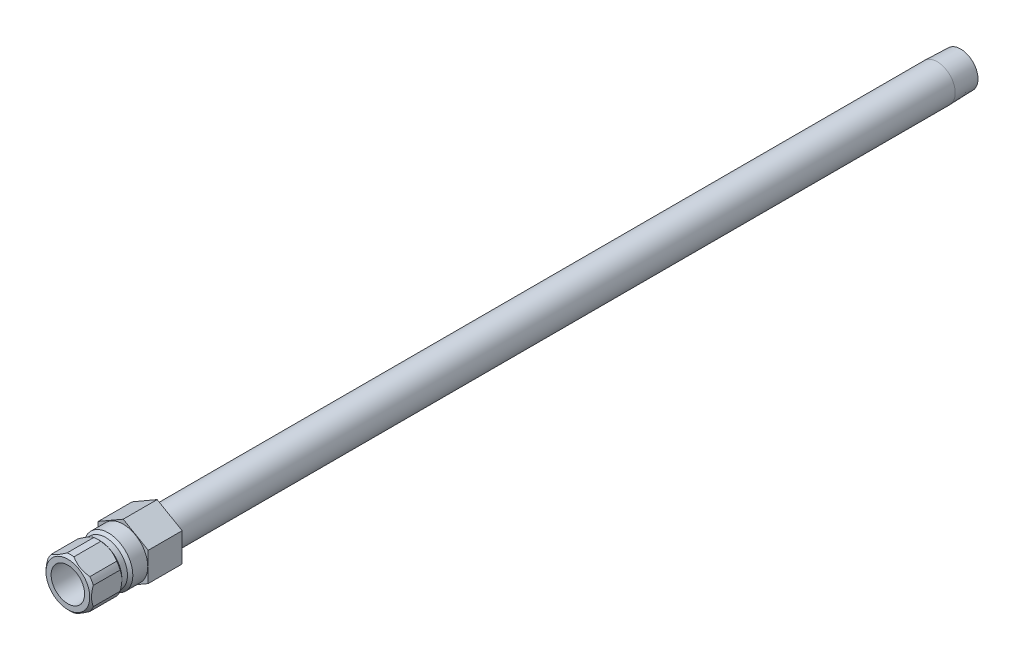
ISO-10303-21;
HEADER;
FILE_DESCRIPTION(('STEP AP214'),'2;1');
FILE_NAME('part.step','',(''),(''),'','','');
FILE_SCHEMA(('AUTOMOTIVE_DESIGN { 1 0 10303 214 1 1 1 1 }'));
ENDSEC;
DATA;
#1=APPLICATION_CONTEXT('core data for automotive mechanical design processes');
#2=APPLICATION_PROTOCOL_DEFINITION('international standard','automotive_design',2000,#1);
#3=PRODUCT_CONTEXT('',#1,'mechanical');
#4=PRODUCT('Part','Part','',(#3));
#5=PRODUCT_RELATED_PRODUCT_CATEGORY('part','',(#4));
#6=PRODUCT_DEFINITION_FORMATION('','',#4);
#7=PRODUCT_DEFINITION_CONTEXT('part definition',#1,'design');
#8=PRODUCT_DEFINITION('design','',#6,#7);
#9=PRODUCT_DEFINITION_SHAPE('','',#8);
#10=(LENGTH_UNIT() NAMED_UNIT(*) SI_UNIT(.MILLI.,.METRE.));
#11=(NAMED_UNIT(*) PLANE_ANGLE_UNIT() SI_UNIT($,.RADIAN.));
#12=(NAMED_UNIT(*) SI_UNIT($,.STERADIAN.) SOLID_ANGLE_UNIT());
#13=UNCERTAINTY_MEASURE_WITH_UNIT(LENGTH_MEASURE(1.E-05),#10,'distance_accuracy_value','');
#14=(GEOMETRIC_REPRESENTATION_CONTEXT(3) GLOBAL_UNCERTAINTY_ASSIGNED_CONTEXT((#13)) GLOBAL_UNIT_ASSIGNED_CONTEXT((#10,
#11,#12)) REPRESENTATION_CONTEXT('',''));
#15=CARTESIAN_POINT('',(0.,0.,0.));
#16=DIRECTION('',(0.,0.,1.));
#17=DIRECTION('',(1.,0.,0.));
#18=AXIS2_PLACEMENT_3D('',#15,#16,#17);
#19=CARTESIAN_POINT('',(0.,0.,-9.652));
#20=DIRECTION('',(0.,0.,-1.));
#21=DIRECTION('',(0.,1.,0.));
#22=AXIS2_PLACEMENT_3D('',#19,#20,#21);
#23=CYLINDRICAL_SURFACE('',#22,6.985);
#24=DIRECTION('',(0.,0.,-1.));
#25=VECTOR('',#24,1.);
#26=CARTESIAN_POINT('',(6.477,2.61509005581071,-9.652));
#27=LINE('',#26,#25);
#28=CARTESIAN_POINT('',(6.477,2.61509005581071,7.366));
#29=VERTEX_POINT('',#28);
#30=CARTESIAN_POINT('',(6.477,2.61509005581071,14.986));
#31=VERTEX_POINT('',#30);
#32=EDGE_CURVE('E372',#29,#31,#27,.F.);
#33=ORIENTED_EDGE('',*,*,#32,.F.);
#34=CARTESIAN_POINT('',(0.,0.,7.366));
#35=DIRECTION('',(0.,0.,-1.));
#36=DIRECTION('',(0.,1.,0.));
#37=AXIS2_PLACEMENT_3D('',#34,#35,#36);
#38=CIRCLE('',#37,6.985);
#39=CARTESIAN_POINT('',(5.50323442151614,4.30170151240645,7.366));
#40=VERTEX_POINT('',#39);
#41=EDGE_CURVE('E190',#40,#29,#38,.T.);
#42=ORIENTED_EDGE('',*,*,#41,.F.);
#43=DIRECTION('',(0.,0.,-1.));
#44=VECTOR('',#43,1.);
#45=CARTESIAN_POINT('',(5.50323442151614,4.30170151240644,-9.652));
#46=LINE('',#45,#44);
#47=CARTESIAN_POINT('',(5.50323442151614,4.30170151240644,14.986));
#48=VERTEX_POINT('',#47);
#49=EDGE_CURVE('E363',#48,#40,#46,.T.);
#50=ORIENTED_EDGE('',*,*,#49,.F.);
#51=CARTESIAN_POINT('',(0.,0.,14.986));
#52=DIRECTION('',(0.,0.,-1.));
#53=DIRECTION('',(0.,1.,0.));
#54=AXIS2_PLACEMENT_3D('',#51,#52,#53);
#55=CIRCLE('',#54,6.985);
#56=EDGE_CURVE('E205',#48,#31,#55,.T.);
#57=ORIENTED_EDGE('',*,*,#56,.T.);
#58=EDGE_LOOP('',(#33,#42,#50,#57));
#59=FACE_BOUND('',#58,.T.);
#60=ADVANCED_FACE('F34',(#59),#23,.T.);
#61=DIRECTION('',(0.,0.,-1.));
#62=VECTOR('',#61,1.);
#63=CARTESIAN_POINT('',(0.97376557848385,6.91679156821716,-9.652));
#64=LINE('',#63,#62);
#65=CARTESIAN_POINT('',(0.973765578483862,6.91679156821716,7.366));
#66=VERTEX_POINT('',#65);
#67=CARTESIAN_POINT('',(0.97376557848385,6.91679156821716,14.986));
#68=VERTEX_POINT('',#67);
#69=EDGE_CURVE('E283',#66,#68,#64,.F.);
#70=ORIENTED_EDGE('',*,*,#69,.F.);
#71=CARTESIAN_POINT('',(-0.973765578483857,6.91679156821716,7.366));
#72=VERTEX_POINT('',#71);
#73=EDGE_CURVE('E194',#72,#66,#38,.T.);
#74=ORIENTED_EDGE('',*,*,#73,.F.);
#75=DIRECTION('',(0.,0.,-1.));
#76=VECTOR('',#75,1.);
#77=CARTESIAN_POINT('',(-0.97376557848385,6.91679156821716,-9.652));
#78=LINE('',#77,#76);
#79=CARTESIAN_POINT('',(-0.97376557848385,6.91679156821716,14.986));
#80=VERTEX_POINT('',#79);
#81=EDGE_CURVE('E54',#80,#72,#78,.T.);
#82=ORIENTED_EDGE('',*,*,#81,.F.);
#83=EDGE_CURVE('E193',#80,#68,#55,.T.);
#84=ORIENTED_EDGE('',*,*,#83,.T.);
#85=EDGE_LOOP('',(#70,#74,#82,#84));
#86=FACE_BOUND('',#85,.T.);
#87=ADVANCED_FACE('F317',(#86),#23,.T.);
#88=DIRECTION('',(0.,0.,-1.));
#89=VECTOR('',#88,1.);
#90=CARTESIAN_POINT('',(-5.50323442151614,4.30170151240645,-9.652));
#91=LINE('',#90,#89);
#92=CARTESIAN_POINT('',(-5.50323442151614,4.30170151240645,7.366));
#93=VERTEX_POINT('',#92);
#94=CARTESIAN_POINT('',(-5.50323442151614,4.30170151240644,14.986));
#95=VERTEX_POINT('',#94);
#96=EDGE_CURVE('E361',#93,#95,#91,.F.);
#97=ORIENTED_EDGE('',*,*,#96,.F.);
#98=CARTESIAN_POINT('',(-6.477,2.6150900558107,7.366));
#99=VERTEX_POINT('',#98);
#100=EDGE_CURVE('E199',#99,#93,#38,.T.);
#101=ORIENTED_EDGE('',*,*,#100,.F.);
#102=DIRECTION('',(0.,0.,-1.));
#103=VECTOR('',#102,1.);
#104=CARTESIAN_POINT('',(-6.477,2.61509005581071,-9.652));
#105=LINE('',#104,#103);
#106=CARTESIAN_POINT('',(-6.477,2.6150900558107,14.986));
#107=VERTEX_POINT('',#106);
#108=EDGE_CURVE('E62',#107,#99,#105,.T.);
#109=ORIENTED_EDGE('',*,*,#108,.F.);
#110=EDGE_CURVE('E204',#107,#95,#55,.T.);
#111=ORIENTED_EDGE('',*,*,#110,.T.);
#112=EDGE_LOOP('',(#97,#101,#109,#111));
#113=FACE_BOUND('',#112,.T.);
#114=ADVANCED_FACE('F322',(#113),#23,.T.);
#115=DIRECTION('',(0.,0.,-1.));
#116=VECTOR('',#115,1.);
#117=CARTESIAN_POINT('',(-6.477,-2.61509005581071,-9.652));
#118=LINE('',#117,#116);
#119=CARTESIAN_POINT('',(-6.477,-2.61509005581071,7.366));
#120=VERTEX_POINT('',#119);
#121=CARTESIAN_POINT('',(-6.477,-2.61509005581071,14.986));
#122=VERTEX_POINT('',#121);
#123=EDGE_CURVE('E353',#120,#122,#118,.F.);
#124=ORIENTED_EDGE('',*,*,#123,.F.);
#125=CARTESIAN_POINT('',(-5.50323442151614,-4.30170151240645,7.366));
#126=VERTEX_POINT('',#125);
#127=EDGE_CURVE('E195',#126,#120,#38,.T.);
#128=ORIENTED_EDGE('',*,*,#127,.F.);
#129=DIRECTION('',(0.,0.,-1.));
#130=VECTOR('',#129,1.);
#131=CARTESIAN_POINT('',(-5.50323442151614,-4.30170151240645,-9.652));
#132=LINE('',#131,#130);
#133=CARTESIAN_POINT('',(-5.50323442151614,-4.30170151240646,14.986));
#134=VERTEX_POINT('',#133);
#135=EDGE_CURVE('E239',#134,#126,#132,.T.);
#136=ORIENTED_EDGE('',*,*,#135,.F.);
#137=EDGE_CURVE('E367',#134,#122,#55,.T.);
#138=ORIENTED_EDGE('',*,*,#137,.T.);
#139=EDGE_LOOP('',(#124,#128,#136,#138));
#140=FACE_BOUND('',#139,.T.);
#141=ADVANCED_FACE('F332',(#140),#23,.T.);
#142=DIRECTION('',(0.,0.,-1.));
#143=VECTOR('',#142,1.);
#144=CARTESIAN_POINT('',(-0.973765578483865,-6.91679156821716,-9.652));
#145=LINE('',#144,#143);
#146=CARTESIAN_POINT('',(-0.973765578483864,-6.91679156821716,7.366));
#147=VERTEX_POINT('',#146);
#148=CARTESIAN_POINT('',(-0.973765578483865,-6.91679156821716,14.986));
#149=VERTEX_POINT('',#148);
#150=EDGE_CURVE('E342',#147,#149,#145,.F.);
#151=ORIENTED_EDGE('',*,*,#150,.F.);
#152=CARTESIAN_POINT('',(0.973765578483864,-6.91679156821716,7.366));
#153=VERTEX_POINT('',#152);
#154=EDGE_CURVE('E191',#153,#147,#38,.T.);
#155=ORIENTED_EDGE('',*,*,#154,.F.);
#156=DIRECTION('',(0.,0.,-1.));
#157=VECTOR('',#156,1.);
#158=CARTESIAN_POINT('',(0.973765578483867,-6.91679156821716,-9.652));
#159=LINE('',#158,#157);
#160=CARTESIAN_POINT('',(0.973765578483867,-6.91679156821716,14.986));
#161=VERTEX_POINT('',#160);
#162=EDGE_CURVE('E168',#161,#153,#159,.T.);
#163=ORIENTED_EDGE('',*,*,#162,.F.);
#164=EDGE_CURVE('E344',#161,#149,#55,.T.);
#165=ORIENTED_EDGE('',*,*,#164,.T.);
#166=EDGE_LOOP('',(#151,#155,#163,#165));
#167=FACE_BOUND('',#166,.T.);
#168=ADVANCED_FACE('F326',(#167),#23,.T.);
#169=CARTESIAN_POINT('',(0.,0.,-9.652));
#170=DIRECTION('',(0.,0.,-1.));
#171=DIRECTION('',(0.,1.,0.));
#172=AXIS2_PLACEMENT_3D('',#169,#170,#171);
#173=CYLINDRICAL_SURFACE('',#172,4.7625);
#174=CARTESIAN_POINT('',(0.,0.,3.556));
#175=DIRECTION('',(0.,0.,-1.));
#176=DIRECTION('',(0.,1.,0.));
#177=AXIS2_PLACEMENT_3D('',#174,#175,#176);
#178=CIRCLE('',#177,4.7625);
#179=CARTESIAN_POINT('',(0.,4.7625,3.556));
#180=VERTEX_POINT('',#179);
#181=EDGE_CURVE('E420',#180,#180,#178,.T.);
#182=ORIENTED_EDGE('',*,*,#181,.T.);
#183=EDGE_LOOP('',(#182));
#184=FACE_BOUND('',#183,.T.);
#185=CARTESIAN_POINT('',(0.,0.,15.748));
#186=DIRECTION('',(0.,0.,-1.));
#187=DIRECTION('',(0.,1.,0.));
#188=AXIS2_PLACEMENT_3D('',#185,#186,#187);
#189=CIRCLE('',#188,4.7625);
#190=CARTESIAN_POINT('',(0.,4.7625,15.748));
#191=VERTEX_POINT('',#190);
#192=EDGE_CURVE('E209',#191,#191,#189,.T.);
#193=ORIENTED_EDGE('',*,*,#192,.F.);
#194=EDGE_LOOP('',(#193));
#195=FACE_BOUND('',#194,.T.);
#196=ADVANCED_FACE('F36',(#184,#195),#173,.F.);
#197=CARTESIAN_POINT('',(0.,4.7625,15.748));
#198=DIRECTION('',(0.,0.,1.));
#199=DIRECTION('',(0.,-1.,0.));
#200=AXIS2_PLACEMENT_3D('',#197,#198,#199);
#201=PLANE('',#200);
#202=ORIENTED_EDGE('',*,*,#192,.T.);
#203=EDGE_LOOP('',(#202));
#204=FACE_BOUND('',#203,.T.);
#205=CARTESIAN_POINT('',(0.,0.,15.748));
#206=DIRECTION('',(0.,0.,-1.));
#207=DIRECTION('',(0.,1.,0.));
#208=AXIS2_PLACEMENT_3D('',#205,#206,#207);
#209=CIRCLE('',#208,6.223);
#210=CARTESIAN_POINT('',(0.,6.223,15.748));
#211=VERTEX_POINT('',#210);
#212=EDGE_CURVE('E206',#211,#211,#209,.T.);
#213=ORIENTED_EDGE('',*,*,#212,.F.);
#214=EDGE_LOOP('',(#213));
#215=FACE_BOUND('',#214,.T.);
#216=ADVANCED_FACE('F245',(#204,#215),#201,.T.);
#217=CARTESIAN_POINT('',(0.,0.,14.986));
#218=DIRECTION('',(0.,0.,-1.));
#219=DIRECTION('',(0.,1.,0.));
#220=AXIS2_PLACEMENT_3D('',#217,#218,#219);
#221=CONICAL_SURFACE('',#220,6.985,0.785398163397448);
#222=CARTESIAN_POINT('',(6.477,-7.50531717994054,12.0573066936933));
#223=CARTESIAN_POINT('',(6.477,-7.32278230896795,12.1954662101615));
#224=CARTESIAN_POINT('',(6.477,-7.13923073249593,12.3323042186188));
#225=CARTESIAN_POINT('',(6.477,-6.76969107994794,12.6027438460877));
#226=CARTESIAN_POINT('',(6.477,-6.58370240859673,12.7363446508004));
#227=CARTESIAN_POINT('',(6.477,-6.20752484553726,13.0006667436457));
#228=CARTESIAN_POINT('',(6.477,-6.01731457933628,13.1313577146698));
#229=CARTESIAN_POINT('',(6.477,-5.63367369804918,13.3879087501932));
#230=CARTESIAN_POINT('',(6.477,-5.44024331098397,13.5137691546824));
#231=CARTESIAN_POINT('',(6.477,-5.03831720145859,13.7667102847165));
#232=CARTESIAN_POINT('',(6.477,-4.82959841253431,13.8934383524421));
#233=CARTESIAN_POINT('',(6.477,-4.4072839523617,14.1386241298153));
#234=CARTESIAN_POINT('',(6.477,-4.19368750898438,14.2570805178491));
#235=CARTESIAN_POINT('',(6.477,-3.76162676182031,14.4831715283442));
#236=CARTESIAN_POINT('',(6.477,-3.54317924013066,14.5908379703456));
#237=CARTESIAN_POINT('',(6.477,-3.10029556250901,14.7929384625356));
#238=CARTESIAN_POINT('',(6.477,-2.87586219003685,14.8873785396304));
#239=CARTESIAN_POINT('',(6.477,-2.43955826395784,15.0524966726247));
#240=CARTESIAN_POINT('',(6.477,-2.22819339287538,15.1244971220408));
#241=CARTESIAN_POINT('',(6.477,-1.80033354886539,15.2515475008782));
#242=CARTESIAN_POINT('',(6.477,-1.58383822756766,15.3065962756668));
#243=CARTESIAN_POINT('',(6.477,-1.1506339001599,15.3959385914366));
#244=CARTESIAN_POINT('',(6.477,-0.934000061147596,15.4305906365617));
#245=CARTESIAN_POINT('',(6.477,-0.498364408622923,15.4784594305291));
#246=CARTESIAN_POINT('',(6.477,-0.2793630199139,15.4916799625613));
#247=CARTESIAN_POINT('',(6.477,0.150697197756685,15.4956835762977));
#248=CARTESIAN_POINT('',(6.477,0.361748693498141,15.4872823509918));
#249=CARTESIAN_POINT('',(6.477,0.782066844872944,15.4503172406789));
#250=CARTESIAN_POINT('',(6.477,0.991333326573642,15.421751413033));
#251=CARTESIAN_POINT('',(6.477,1.41010575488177,15.3455375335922));
#252=CARTESIAN_POINT('',(6.477,1.6195513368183,15.2975631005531));
#253=CARTESIAN_POINT('',(6.477,2.03387291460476,15.1851046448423));
#254=CARTESIAN_POINT('',(6.477,2.23874927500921,15.1206219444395));
#255=CARTESIAN_POINT('',(6.477,2.66141718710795,14.9715598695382));
#256=CARTESIAN_POINT('',(6.477,2.87875617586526,14.8857103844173));
#257=CARTESIAN_POINT('',(6.477,3.30779766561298,14.7008180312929));
#258=CARTESIAN_POINT('',(6.477,3.51949749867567,14.6017690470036));
#259=CARTESIAN_POINT('',(6.477,3.93828980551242,14.3928329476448));
#260=CARTESIAN_POINT('',(6.477,4.14536521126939,14.282911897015));
#261=CARTESIAN_POINT('',(6.477,4.55475391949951,14.0546596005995));
#262=CARTESIAN_POINT('',(6.477,4.75706796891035,13.93632968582));
#263=CARTESIAN_POINT('',(6.477,5.14761370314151,13.6989609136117));
#264=CARTESIAN_POINT('',(6.477,5.33604552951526,13.580249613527));
#265=CARTESIAN_POINT('',(6.477,5.70967381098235,13.3378251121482));
#266=CARTESIAN_POINT('',(6.477,5.89487001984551,13.2141115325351));
#267=CARTESIAN_POINT('',(6.477,6.26095063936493,12.9635958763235));
#268=CARTESIAN_POINT('',(6.477,6.4418578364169,12.8368269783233));
#269=CARTESIAN_POINT('',(6.477,6.80119835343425,12.5799293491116));
#270=CARTESIAN_POINT('',(6.477,6.97963234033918,12.4498015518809));
#271=CARTESIAN_POINT('',(6.477,7.15703038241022,12.3183002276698));
#272=B_SPLINE_CURVE_WITH_KNOTS('',3,(#222,#223,#224,#225,#226,#227,#228,#229,#230,#231,#232,
#233,#234,#235,#236,#237,#238,#239,#240,#241,#242,#243,#244,#245,#246,#247,#248,#249,#250,#251,
#252,#253,#254,#255,#256,#257,#258,#259,#260,#261,#262,#263,#264,#265,#266,#267,#268,#269,#270,
#271),.UNSPECIFIED.,.F.,.F.,(4,2,2,2,2,2,2,2,2,2,2,2,2,2,2,2,2,2,2,2,2,2,2,2,4),(0.,
0.68679090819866,1.37375281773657,2.06603541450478,2.75826919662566,3.49065471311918,
4.22315698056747,4.95343127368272,5.68337170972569,6.35265989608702,7.02199365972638,
7.67918147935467,8.33625327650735,8.96890298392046,9.60161364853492,10.2454384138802,
10.8892116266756,11.5897073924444,12.2905288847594,12.9936114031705,13.696582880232,
14.3646145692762,15.0326968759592,15.6953618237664,16.3578444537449),.UNSPECIFIED.);
#273=CARTESIAN_POINT('',(6.477,-2.61509005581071,14.986));
#274=VERTEX_POINT('',#273);
#275=EDGE_CURVE('E375',#31,#274,#272,.F.);
#276=ORIENTED_EDGE('',*,*,#275,.F.);
#277=ORIENTED_EDGE('',*,*,#56,.F.);
#278=CARTESIAN_POINT('',(0.973302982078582,6.91705864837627,14.9858));
#279=CARTESIAN_POINT('',(1.1543052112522,6.81255696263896,15.0641166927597));
#280=CARTESIAN_POINT('',(1.3378209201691,6.70660411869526,15.1353544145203));
#281=CARTESIAN_POINT('',(1.70963160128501,6.49193912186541,15.2608524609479));
#282=CARTESIAN_POINT('',(1.89793754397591,6.38322063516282,15.3150691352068));
#283=CARTESIAN_POINT('',(2.27146153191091,6.16756646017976,15.401724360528));
#284=CARTESIAN_POINT('',(2.45655498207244,6.06070270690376,15.4348622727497));
#285=CARTESIAN_POINT('',(2.82844640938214,5.8459910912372,15.4802195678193));
#286=CARTESIAN_POINT('',(3.0152419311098,5.73814464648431,15.4924653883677));
#287=CARTESIAN_POINT('',(3.3948057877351,5.51900335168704,15.4953056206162));
#288=CARTESIAN_POINT('',(3.58757842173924,5.40770601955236,15.4852117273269));
#289=CARTESIAN_POINT('',(3.97148128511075,5.18605959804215,15.4426708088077));
#290=CARTESIAN_POINT('',(4.16260891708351,5.0757120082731,15.4101933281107));
#291=CARTESIAN_POINT('',(4.54854122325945,4.85289388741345,15.3234273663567));
#292=CARTESIAN_POINT('',(4.74321398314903,4.74049951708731,15.268364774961));
#293=CARTESIAN_POINT('',(5.03141021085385,4.5741093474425,15.1720079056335));
#294=CARTESIAN_POINT('',(5.12673323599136,4.51907457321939,15.1376422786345));
#295=CARTESIAN_POINT('',(5.31613879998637,4.40972121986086,15.0647445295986));
#296=CARTESIAN_POINT('',(5.41022179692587,4.35540237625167,15.0262139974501));
#297=CARTESIAN_POINT('',(5.50369701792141,4.30143443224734,14.9858));
#298=B_SPLINE_CURVE_WITH_KNOTS('',3,(#278,#279,#280,#281,#282,#283,#284,#285,#286,#287,#288,
#289,#290,#291,#292,#293,#294,#295,#296,#297),.UNSPECIFIED.,.F.,.F.,(4,2,2,2,2,2,2,2,2,4),(0.,
0.669810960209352,1.34132587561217,1.98920541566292,2.63626449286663,3.30353665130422,
3.97171850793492,4.66502165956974,5.01088265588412,5.35661208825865),.UNSPECIFIED.);
#299=EDGE_CURVE('E275',#68,#48,#298,.T.);
#300=ORIENTED_EDGE('',*,*,#299,.F.);
#301=ORIENTED_EDGE('',*,*,#83,.F.);
#302=CARTESIAN_POINT('',(-5.50369701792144,4.30143443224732,14.9858));
#303=CARTESIAN_POINT('',(-5.32269478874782,4.40593611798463,15.0641166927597));
#304=CARTESIAN_POINT('',(-5.13917907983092,4.51188896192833,15.1353544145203));
#305=CARTESIAN_POINT('',(-4.76736839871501,4.72655395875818,15.2608524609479));
#306=CARTESIAN_POINT('',(-4.57906245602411,4.83527244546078,15.3150691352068));
#307=CARTESIAN_POINT('',(-4.2055384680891,5.05092662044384,15.401724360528));
#308=CARTESIAN_POINT('',(-4.02044501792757,5.15779037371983,15.4348622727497));
#309=CARTESIAN_POINT('',(-3.64855359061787,5.3725019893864,15.4802195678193));
#310=CARTESIAN_POINT('',(-3.46175806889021,5.48034843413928,15.4924653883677));
#311=CARTESIAN_POINT('',(-3.0821942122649,5.69948972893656,15.4953056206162));
#312=CARTESIAN_POINT('',(-2.88942157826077,5.81078706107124,15.4852117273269));
#313=CARTESIAN_POINT('',(-2.50551871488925,6.03243348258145,15.4426708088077));
#314=CARTESIAN_POINT('',(-2.31439108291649,6.1427810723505,15.4101933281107));
#315=CARTESIAN_POINT('',(-1.92845877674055,6.36559919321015,15.3234273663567));
#316=CARTESIAN_POINT('',(-1.73378601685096,6.47799356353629,15.268364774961));
#317=CARTESIAN_POINT('',(-1.44558978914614,6.64438373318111,15.1720079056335));
#318=CARTESIAN_POINT('',(-1.35026676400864,6.69941850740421,15.1376422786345));
#319=CARTESIAN_POINT('',(-1.16086120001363,6.80877186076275,15.0647445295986));
#320=CARTESIAN_POINT('',(-1.06677820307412,6.86309070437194,15.0262139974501));
#321=CARTESIAN_POINT('',(-0.973302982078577,6.91705864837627,14.9858));
#322=B_SPLINE_CURVE_WITH_KNOTS('',3,(#302,#303,#304,#305,#306,#307,#308,#309,#310,#311,#312,
#313,#314,#315,#316,#317,#318,#319,#320,#321),.UNSPECIFIED.,.F.,.F.,(4,2,2,2,2,2,2,2,2,4),(0.,
0.669810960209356,1.34132587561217,1.98920541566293,2.63626449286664,3.30353665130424,
3.97171850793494,4.66502165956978,5.01088265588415,5.35661208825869),.UNSPECIFIED.);
#323=EDGE_CURVE('E267',#95,#80,#322,.T.);
#324=ORIENTED_EDGE('',*,*,#323,.F.);
#325=ORIENTED_EDGE('',*,*,#110,.F.);
#326=CARTESIAN_POINT('',(-6.477,-7.50531717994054,12.0573066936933));
#327=CARTESIAN_POINT('',(-6.477,-7.32278230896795,12.1954662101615));
#328=CARTESIAN_POINT('',(-6.477,-7.13923073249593,12.3323042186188));
#329=CARTESIAN_POINT('',(-6.477,-6.76969107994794,12.6027438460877));
#330=CARTESIAN_POINT('',(-6.477,-6.58370240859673,12.7363446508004));
#331=CARTESIAN_POINT('',(-6.477,-6.20752484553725,13.0006667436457));
#332=CARTESIAN_POINT('',(-6.477,-6.01731457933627,13.1313577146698));
#333=CARTESIAN_POINT('',(-6.477,-5.63367369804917,13.3879087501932));
#334=CARTESIAN_POINT('',(-6.477,-5.44024331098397,13.5137691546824));
#335=CARTESIAN_POINT('',(-6.477,-5.03831720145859,13.7667102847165));
#336=CARTESIAN_POINT('',(-6.477,-4.8295984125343,13.8934383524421));
#337=CARTESIAN_POINT('',(-6.477,-4.4072839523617,14.1386241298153));
#338=CARTESIAN_POINT('',(-6.477,-4.19368750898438,14.2570805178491));
#339=CARTESIAN_POINT('',(-6.477,-3.7616267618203,14.4831715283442));
#340=CARTESIAN_POINT('',(-6.477,-3.54317924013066,14.5908379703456));
#341=CARTESIAN_POINT('',(-6.477,-3.100295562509,14.7929384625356));
#342=CARTESIAN_POINT('',(-6.477,-2.87586219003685,14.8873785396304));
#343=CARTESIAN_POINT('',(-6.477,-2.43955826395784,15.0524966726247));
#344=CARTESIAN_POINT('',(-6.477,-2.22819339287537,15.1244971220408));
#345=CARTESIAN_POINT('',(-6.477,-1.80033354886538,15.2515475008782));
#346=CARTESIAN_POINT('',(-6.477,-1.58383822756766,15.3065962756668));
#347=CARTESIAN_POINT('',(-6.477,-1.15063390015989,15.3959385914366));
#348=CARTESIAN_POINT('',(-6.477,-0.934000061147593,15.4305906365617));
#349=CARTESIAN_POINT('',(-6.477,-0.498364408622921,15.4784594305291));
#350=CARTESIAN_POINT('',(-6.477,-0.279363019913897,15.4916799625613));
#351=CARTESIAN_POINT('',(-6.477,0.150697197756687,15.4956835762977));
#352=CARTESIAN_POINT('',(-6.477,0.361748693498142,15.4872823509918));
#353=CARTESIAN_POINT('',(-6.477,0.782066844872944,15.4503172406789));
#354=CARTESIAN_POINT('',(-6.477,0.991333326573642,15.421751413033));
#355=CARTESIAN_POINT('',(-6.477,1.41010575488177,15.3455375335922));
#356=CARTESIAN_POINT('',(-6.477,1.6195513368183,15.2975631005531));
#357=CARTESIAN_POINT('',(-6.477,2.03387291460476,15.1851046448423));
#358=CARTESIAN_POINT('',(-6.477,2.23874927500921,15.1206219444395));
#359=CARTESIAN_POINT('',(-6.477,2.66141718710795,14.9715598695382));
#360=CARTESIAN_POINT('',(-6.477,2.87875617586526,14.8857103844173));
#361=CARTESIAN_POINT('',(-6.477,3.30779766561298,14.7008180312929));
#362=CARTESIAN_POINT('',(-6.477,3.51949749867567,14.6017690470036));
#363=CARTESIAN_POINT('',(-6.477,3.93828980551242,14.3928329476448));
#364=CARTESIAN_POINT('',(-6.477,4.14536521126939,14.282911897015));
#365=CARTESIAN_POINT('',(-6.477,4.55475391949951,14.0546596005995));
#366=CARTESIAN_POINT('',(-6.477,4.75706796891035,13.93632968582));
#367=CARTESIAN_POINT('',(-6.477,5.14761370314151,13.6989609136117));
#368=CARTESIAN_POINT('',(-6.477,5.33604552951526,13.580249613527));
#369=CARTESIAN_POINT('',(-6.477,5.70967381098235,13.3378251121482));
#370=CARTESIAN_POINT('',(-6.477,5.89487001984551,13.2141115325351));
#371=CARTESIAN_POINT('',(-6.477,6.26095063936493,12.9635958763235));
#372=CARTESIAN_POINT('',(-6.477,6.4418578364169,12.8368269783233));
#373=CARTESIAN_POINT('',(-6.477,6.80119835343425,12.5799293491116));
#374=CARTESIAN_POINT('',(-6.477,6.97963234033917,12.4498015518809));
#375=CARTESIAN_POINT('',(-6.477,7.15703038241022,12.3183002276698));
#376=B_SPLINE_CURVE_WITH_KNOTS('',3,(#326,#327,#328,#329,#330,#331,#332,#333,#334,#335,#336,
#337,#338,#339,#340,#341,#342,#343,#344,#345,#346,#347,#348,#349,#350,#351,#352,#353,#354,#355,
#356,#357,#358,#359,#360,#361,#362,#363,#364,#365,#366,#367,#368,#369,#370,#371,#372,#373,#374,
#375),.UNSPECIFIED.,.F.,.F.,(4,2,2,2,2,2,2,2,2,2,2,2,2,2,2,2,2,2,2,2,2,2,2,2,4),(0.,
0.686790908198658,1.37375281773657,2.06603541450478,2.75826919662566,3.49065471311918,
4.22315698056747,4.95343127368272,5.68337170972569,6.35265989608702,7.02199365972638,
7.67918147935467,8.33625327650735,8.96890298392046,9.60161364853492,10.2454384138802,
10.8892116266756,11.5897073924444,12.2905288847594,12.9936114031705,13.696582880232,
14.3646145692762,15.0326968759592,15.6953618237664,16.3578444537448),.UNSPECIFIED.);
#377=EDGE_CURVE('E260',#122,#107,#376,.T.);
#378=ORIENTED_EDGE('',*,*,#377,.F.);
#379=ORIENTED_EDGE('',*,*,#137,.F.);
#380=CARTESIAN_POINT('',(-0.973302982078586,-6.91705864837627,14.9858));
#381=CARTESIAN_POINT('',(-1.1543052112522,-6.81255696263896,15.0641166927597));
#382=CARTESIAN_POINT('',(-1.3378209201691,-6.70660411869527,15.1353544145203));
#383=CARTESIAN_POINT('',(-1.70963160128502,-6.49193912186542,15.2608524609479));
#384=CARTESIAN_POINT('',(-1.89793754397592,-6.38322063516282,15.3150691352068));
#385=CARTESIAN_POINT('',(-2.27146153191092,-6.16756646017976,15.401724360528));
#386=CARTESIAN_POINT('',(-2.45655498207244,-6.06070270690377,15.4348622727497));
#387=CARTESIAN_POINT('',(-2.82844640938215,-5.8459910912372,15.4802195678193));
#388=CARTESIAN_POINT('',(-3.0152419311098,-5.73814464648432,15.4924653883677));
#389=CARTESIAN_POINT('',(-3.39480578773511,-5.51900335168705,15.4953056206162));
#390=CARTESIAN_POINT('',(-3.58757842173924,-5.40770601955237,15.4852117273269));
#391=CARTESIAN_POINT('',(-3.97148128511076,-5.18605959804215,15.4426708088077));
#392=CARTESIAN_POINT('',(-4.16260891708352,-5.0757120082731,15.4101933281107));
#393=CARTESIAN_POINT('',(-4.54854122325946,-4.85289388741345,15.3234273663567));
#394=CARTESIAN_POINT('',(-4.74321398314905,-4.74049951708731,15.268364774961));
#395=CARTESIAN_POINT('',(-5.03141021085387,-4.57410934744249,15.1720079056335));
#396=CARTESIAN_POINT('',(-5.12673323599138,-4.51907457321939,15.1376422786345));
#397=CARTESIAN_POINT('',(-5.31613879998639,-4.40972121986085,15.0647445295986));
#398=CARTESIAN_POINT('',(-5.4102217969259,-4.35540237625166,15.0262139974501));
#399=CARTESIAN_POINT('',(-5.50369701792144,-4.30143443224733,14.9858));
#400=B_SPLINE_CURVE_WITH_KNOTS('',3,(#380,#381,#382,#383,#384,#385,#386,#387,#388,#389,#390,
#391,#392,#393,#394,#395,#396,#397,#398,#399),.UNSPECIFIED.,.F.,.F.,(4,2,2,2,2,2,2,2,2,4),(0.,
0.669810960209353,1.34132587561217,1.98920541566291,2.63626449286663,3.30353665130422,
3.97171850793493,4.66502165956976,5.01088265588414,5.35661208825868),.UNSPECIFIED.);
#401=EDGE_CURVE('E253',#149,#134,#400,.T.);
#402=ORIENTED_EDGE('',*,*,#401,.F.);
#403=ORIENTED_EDGE('',*,*,#164,.F.);
#404=CARTESIAN_POINT('',(5.50369701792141,-4.30143443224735,14.9858));
#405=CARTESIAN_POINT('',(5.32269478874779,-4.40593611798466,15.0641166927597));
#406=CARTESIAN_POINT('',(5.13917907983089,-4.51188896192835,15.1353544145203));
#407=CARTESIAN_POINT('',(4.76736839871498,-4.7265539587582,15.2608524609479));
#408=CARTESIAN_POINT('',(4.57906245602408,-4.8352724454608,15.3150691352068));
#409=CARTESIAN_POINT('',(4.20553846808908,-5.05092662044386,15.401724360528));
#410=CARTESIAN_POINT('',(4.02044501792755,-5.15779037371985,15.4348622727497));
#411=CARTESIAN_POINT('',(3.64855359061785,-5.37250198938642,15.4802195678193));
#412=CARTESIAN_POINT('',(3.46175806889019,-5.4803484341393,15.4924653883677));
#413=CARTESIAN_POINT('',(3.08219421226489,-5.69948972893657,15.4953056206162));
#414=CARTESIAN_POINT('',(2.88942157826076,-5.81078706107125,15.4852117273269));
#415=CARTESIAN_POINT('',(2.50551871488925,-6.03243348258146,15.4426708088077));
#416=CARTESIAN_POINT('',(2.31439108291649,-6.14278107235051,15.4101933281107));
#417=CARTESIAN_POINT('',(1.92845877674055,-6.36559919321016,15.3234273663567));
#418=CARTESIAN_POINT('',(1.73378601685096,-6.4779935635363,15.268364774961));
#419=CARTESIAN_POINT('',(1.44558978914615,-6.64438373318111,15.1720079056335));
#420=CARTESIAN_POINT('',(1.35026676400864,-6.69941850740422,15.1376422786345));
#421=CARTESIAN_POINT('',(1.16086120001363,-6.80877186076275,15.0647445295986));
#422=CARTESIAN_POINT('',(1.06677820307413,-6.86309070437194,15.0262139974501));
#423=CARTESIAN_POINT('',(0.973302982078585,-6.91705864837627,14.9858));
#424=B_SPLINE_CURVE_WITH_KNOTS('',3,(#404,#405,#406,#407,#408,#409,#410,#411,#412,#413,#414,
#415,#416,#417,#418,#419,#420,#421,#422,#423),.UNSPECIFIED.,.F.,.F.,(4,2,2,2,2,2,2,2,2,4),(0.,
0.669810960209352,1.34132587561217,1.98920541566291,2.63626449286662,3.30353665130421,
3.9717185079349,4.66502165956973,5.0108826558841,5.35661208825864),.UNSPECIFIED.);
#425=CARTESIAN_POINT('',(5.50323442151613,-4.30170151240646,14.986));
#426=VERTEX_POINT('',#425);
#427=EDGE_CURVE('E184',#426,#161,#424,.T.);
#428=ORIENTED_EDGE('',*,*,#427,.F.);
#429=EDGE_CURVE('E183',#274,#426,#55,.T.);
#430=ORIENTED_EDGE('',*,*,#429,.F.);
#431=EDGE_LOOP('',(#276,#277,#300,#301,#324,#325,#378,#379,#402,#403,#428,#430));
#432=FACE_BOUND('',#431,.T.);
#433=ORIENTED_EDGE('',*,*,#212,.T.);
#434=EDGE_LOOP('',(#433));
#435=FACE_BOUND('',#434,.T.);
#436=ADVANCED_FACE('F242',(#432,#435),#221,.T.);
#437=DIRECTION('',(0.,0.,-1.));
#438=VECTOR('',#437,1.);
#439=CARTESIAN_POINT('',(6.477,-2.61509005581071,-9.652));
#440=LINE('',#439,#438);
#441=CARTESIAN_POINT('',(6.477,-2.61509005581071,7.366));
#442=VERTEX_POINT('',#441);
#443=EDGE_CURVE('E282',#274,#442,#440,.T.);
#444=ORIENTED_EDGE('',*,*,#443,.F.);
#445=ORIENTED_EDGE('',*,*,#429,.T.);
#446=DIRECTION('',(0.,0.,-1.));
#447=VECTOR('',#446,1.);
#448=CARTESIAN_POINT('',(5.50323442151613,-4.30170151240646,-9.652));
#449=LINE('',#448,#447);
#450=CARTESIAN_POINT('',(5.50323442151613,-4.30170151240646,7.366));
#451=VERTEX_POINT('',#450);
#452=EDGE_CURVE('E165',#451,#426,#449,.F.);
#453=ORIENTED_EDGE('',*,*,#452,.F.);
#454=EDGE_CURVE('E181',#442,#451,#38,.T.);
#455=ORIENTED_EDGE('',*,*,#454,.F.);
#456=EDGE_LOOP('',(#444,#445,#453,#455));
#457=FACE_BOUND('',#456,.T.);
#458=ADVANCED_FACE('F180',(#457),#23,.T.);
#459=CARTESIAN_POINT('',(0.,0.,6.604));
#460=DIRECTION('',(0.,0.,1.));
#461=DIRECTION('',(0.,-1.,0.));
#462=AXIS2_PLACEMENT_3D('',#459,#460,#461);
#463=CONICAL_SURFACE('',#462,6.223,0.785398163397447);
#464=CARTESIAN_POINT('',(6.477,-7.50531717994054,10.2946933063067));
#465=CARTESIAN_POINT('',(6.477,-7.32278230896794,10.1565337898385));
#466=CARTESIAN_POINT('',(6.477,-7.13923073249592,10.0196957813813));
#467=CARTESIAN_POINT('',(6.477,-6.76969107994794,9.74925615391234));
#468=CARTESIAN_POINT('',(6.477,-6.58370240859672,9.61565534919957));
#469=CARTESIAN_POINT('',(6.477,-6.20752484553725,9.35133325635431));
#470=CARTESIAN_POINT('',(6.477,-6.01731457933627,9.22064228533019));
#471=CARTESIAN_POINT('',(6.477,-5.63367369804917,8.96409124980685));
#472=CARTESIAN_POINT('',(6.477,-5.44024331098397,8.83823084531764));
#473=CARTESIAN_POINT('',(6.477,-5.03831720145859,8.58528971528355));
#474=CARTESIAN_POINT('',(6.477,-4.82959841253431,8.45856164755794));
#475=CARTESIAN_POINT('',(6.477,-4.4072839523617,8.21337587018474));
#476=CARTESIAN_POINT('',(6.477,-4.19368750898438,8.09491948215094));
#477=CARTESIAN_POINT('',(6.477,-3.76162676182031,7.8688284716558));
#478=CARTESIAN_POINT('',(6.477,-3.54317924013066,7.76116202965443));
#479=CARTESIAN_POINT('',(6.477,-3.10029556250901,7.55906153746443));
#480=CARTESIAN_POINT('',(6.477,-2.87586219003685,7.46462146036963));
#481=CARTESIAN_POINT('',(6.477,-2.43955826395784,7.2995033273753));
#482=CARTESIAN_POINT('',(6.477,-2.22819339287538,7.2275028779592));
#483=CARTESIAN_POINT('',(6.477,-1.80033354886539,7.10045249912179));
#484=CARTESIAN_POINT('',(6.477,-1.58383822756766,7.0454037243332));
#485=CARTESIAN_POINT('',(6.477,-1.1506339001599,6.95606140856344));
#486=CARTESIAN_POINT('',(6.477,-0.934000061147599,6.92140936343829));
#487=CARTESIAN_POINT('',(6.477,-0.498364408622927,6.87354056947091));
#488=CARTESIAN_POINT('',(6.477,-0.279363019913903,6.86032003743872));
#489=CARTESIAN_POINT('',(6.477,0.15069719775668,6.85631642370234));
#490=CARTESIAN_POINT('',(6.477,0.361748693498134,6.8647176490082));
#491=CARTESIAN_POINT('',(6.477,0.782066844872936,6.90168275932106));
#492=CARTESIAN_POINT('',(6.477,0.991333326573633,6.93024858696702));
#493=CARTESIAN_POINT('',(6.477,1.41010575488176,7.00646246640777));
#494=CARTESIAN_POINT('',(6.477,1.61955133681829,7.05443689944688));
#495=CARTESIAN_POINT('',(6.477,2.03387291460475,7.16689535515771));
#496=CARTESIAN_POINT('',(6.477,2.2387492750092,7.23137805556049));
#497=CARTESIAN_POINT('',(6.477,2.66141718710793,7.38044013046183));
#498=CARTESIAN_POINT('',(6.477,2.87875617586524,7.46628961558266));
#499=CARTESIAN_POINT('',(6.477,3.30779766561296,7.65118196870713));
#500=CARTESIAN_POINT('',(6.477,3.51949749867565,7.75023095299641));
#501=CARTESIAN_POINT('',(6.477,3.93828980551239,7.95916705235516));
#502=CARTESIAN_POINT('',(6.477,4.14536521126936,8.069088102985));
#503=CARTESIAN_POINT('',(6.477,4.55475391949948,8.29734039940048));
#504=CARTESIAN_POINT('',(6.477,4.75706796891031,8.41567031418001));
#505=CARTESIAN_POINT('',(6.477,5.14761370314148,8.65303908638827));
#506=CARTESIAN_POINT('',(6.477,5.33604552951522,8.77175038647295));
#507=CARTESIAN_POINT('',(6.477,5.70967381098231,9.01417488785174));
#508=CARTESIAN_POINT('',(6.477,5.89487001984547,9.13788846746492));
#509=CARTESIAN_POINT('',(6.477,6.26095063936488,9.38840412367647));
#510=CARTESIAN_POINT('',(6.477,6.44185783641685,9.5151730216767));
#511=CARTESIAN_POINT('',(6.477,6.8011983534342,9.77207065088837));
#512=CARTESIAN_POINT('',(6.477,6.97963234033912,9.90219844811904));
#513=CARTESIAN_POINT('',(6.477,7.15703038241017,10.0336997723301));
#514=B_SPLINE_CURVE_WITH_KNOTS('',3,(#464,#465,#466,#467,#468,#469,#470,#471,#472,#473,#474,
#475,#476,#477,#478,#479,#480,#481,#482,#483,#484,#485,#486,#487,#488,#489,#490,#491,#492,#493,
#494,#495,#496,#497,#498,#499,#500,#501,#502,#503,#504,#505,#506,#507,#508,#509,#510,#511,#512,
#513),.UNSPECIFIED.,.F.,.F.,(4,2,2,2,2,2,2,2,2,2,2,2,2,2,2,2,2,2,2,2,2,2,2,2,4),(0.,
0.686790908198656,1.37375281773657,2.06603541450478,2.75826919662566,3.49065471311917,
4.22315698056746,4.95343127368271,5.68337170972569,6.35265989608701,7.02199365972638,
7.67918147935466,8.33625327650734,8.96890298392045,9.6016136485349,10.2454384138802,
10.8892116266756,11.5897073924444,12.2905288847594,12.9936114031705,13.6965828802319,
14.3646145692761,15.0326968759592,15.6953618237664,16.3578444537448),.UNSPECIFIED.);
#515=EDGE_CURVE('E12',#442,#29,#514,.T.);
#516=ORIENTED_EDGE('',*,*,#515,.F.);
#517=ORIENTED_EDGE('',*,*,#454,.T.);
#518=CARTESIAN_POINT('',(0.973302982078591,-6.91705864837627,7.3662));
#519=CARTESIAN_POINT('',(1.15430521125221,-6.81255696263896,7.28788330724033));
#520=CARTESIAN_POINT('',(1.33782092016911,-6.70660411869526,7.21664558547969));
#521=CARTESIAN_POINT('',(1.70963160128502,-6.49193912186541,7.09114753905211));
#522=CARTESIAN_POINT('',(1.89793754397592,-6.38322063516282,7.03693086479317));
#523=CARTESIAN_POINT('',(2.27146153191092,-6.16756646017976,6.95027563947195));
#524=CARTESIAN_POINT('',(2.45655498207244,-6.06070270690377,6.91713772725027));
#525=CARTESIAN_POINT('',(2.82844640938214,-5.8459910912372,6.87178043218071));
#526=CARTESIAN_POINT('',(3.0152419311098,-5.73814464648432,6.85953461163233));
#527=CARTESIAN_POINT('',(3.3948057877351,-5.51900335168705,6.85669437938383));
#528=CARTESIAN_POINT('',(3.58757842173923,-5.40770601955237,6.86678827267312));
#529=CARTESIAN_POINT('',(3.97148128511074,-5.18605959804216,6.90932919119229));
#530=CARTESIAN_POINT('',(4.1626089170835,-5.07571200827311,6.94180667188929));
#531=CARTESIAN_POINT('',(4.54854122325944,-4.85289388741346,7.02857263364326));
#532=CARTESIAN_POINT('',(4.74321398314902,-4.74049951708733,7.08363522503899));
#533=CARTESIAN_POINT('',(5.03141021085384,-4.57410934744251,7.17999209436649));
#534=CARTESIAN_POINT('',(5.12673323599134,-4.51907457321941,7.21435772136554));
#535=CARTESIAN_POINT('',(5.31613879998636,-4.40972121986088,7.28725547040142));
#536=CARTESIAN_POINT('',(5.41022179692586,-4.35540237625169,7.32578600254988));
#537=CARTESIAN_POINT('',(5.5036970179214,-4.30143443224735,7.3662));
#538=B_SPLINE_CURVE_WITH_KNOTS('',3,(#518,#519,#520,#521,#522,#523,#524,#525,#526,#527,#528,
#529,#530,#531,#532,#533,#534,#535,#536,#537),.UNSPECIFIED.,.F.,.F.,(4,2,2,2,2,2,2,2,2,4),(0.,
0.669810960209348,1.34132587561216,1.98920541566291,2.63626449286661,3.3035366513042,
3.97171850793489,4.66502165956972,5.01088265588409,5.35661208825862),.UNSPECIFIED.);
#539=EDGE_CURVE('E162',#153,#451,#538,.T.);
#540=ORIENTED_EDGE('',*,*,#539,.F.);
#541=ORIENTED_EDGE('',*,*,#154,.T.);
#542=CARTESIAN_POINT('',(-5.50369701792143,-4.30143443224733,7.36620000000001));
#543=CARTESIAN_POINT('',(-5.32269478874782,-4.40593611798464,7.28788330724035));
#544=CARTESIAN_POINT('',(-5.13917907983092,-4.51188896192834,7.2166455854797));
#545=CARTESIAN_POINT('',(-4.767368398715,-4.72655395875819,7.09114753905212));
#546=CARTESIAN_POINT('',(-4.5790624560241,-4.83527244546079,7.03693086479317));
#547=CARTESIAN_POINT('',(-4.2055384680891,-5.05092662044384,6.95027563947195));
#548=CARTESIAN_POINT('',(-4.02044501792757,-5.15779037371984,6.91713772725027));
#549=CARTESIAN_POINT('',(-3.64855359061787,-5.37250198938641,6.87178043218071));
#550=CARTESIAN_POINT('',(-3.46175806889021,-5.48034843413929,6.85953461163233));
#551=CARTESIAN_POINT('',(-3.08219421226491,-5.69948972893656,6.85669437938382));
#552=CARTESIAN_POINT('',(-2.88942157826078,-5.81078706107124,6.86678827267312));
#553=CARTESIAN_POINT('',(-2.50551871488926,-6.03243348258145,6.90932919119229));
#554=CARTESIAN_POINT('',(-2.3143910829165,-6.1427810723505,6.94180667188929));
#555=CARTESIAN_POINT('',(-1.92845877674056,-6.36559919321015,7.02857263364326));
#556=CARTESIAN_POINT('',(-1.73378601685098,-6.47799356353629,7.08363522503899));
#557=CARTESIAN_POINT('',(-1.44558978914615,-6.6443837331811,7.17999209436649));
#558=CARTESIAN_POINT('',(-1.35026676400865,-6.69941850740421,7.21435772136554));
#559=CARTESIAN_POINT('',(-1.16086120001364,-6.80877186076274,7.28725547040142));
#560=CARTESIAN_POINT('',(-1.06677820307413,-6.86309070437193,7.32578600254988));
#561=CARTESIAN_POINT('',(-0.973302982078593,-6.91705864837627,7.3662));
#562=B_SPLINE_CURVE_WITH_KNOTS('',3,(#542,#543,#544,#545,#546,#547,#548,#549,#550,#551,#552,
#553,#554,#555,#556,#557,#558,#559,#560,#561),.UNSPECIFIED.,.F.,.F.,(4,2,2,2,2,2,2,2,2,4),(0.,
0.669810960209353,1.34132587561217,1.98920541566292,2.63626449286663,3.30353665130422,
3.97171850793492,4.66502165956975,5.01088265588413,5.35661208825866),.UNSPECIFIED.);
#563=EDGE_CURVE('E173',#126,#147,#562,.T.);
#564=ORIENTED_EDGE('',*,*,#563,.F.);
#565=ORIENTED_EDGE('',*,*,#127,.T.);
#566=CARTESIAN_POINT('',(-6.477,-7.50531717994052,10.2946933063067));
#567=CARTESIAN_POINT('',(-6.477,-7.32278230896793,10.1565337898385));
#568=CARTESIAN_POINT('',(-6.477,-7.13923073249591,10.0196957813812));
#569=CARTESIAN_POINT('',(-6.477,-6.76969107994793,9.74925615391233));
#570=CARTESIAN_POINT('',(-6.477,-6.58370240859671,9.61565534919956));
#571=CARTESIAN_POINT('',(-6.477,-6.20752484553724,9.35133325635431));
#572=CARTESIAN_POINT('',(-6.477,-6.01731457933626,9.22064228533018));
#573=CARTESIAN_POINT('',(-6.477,-5.63367369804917,8.96409124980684));
#574=CARTESIAN_POINT('',(-6.477,-5.44024331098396,8.83823084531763));
#575=CARTESIAN_POINT('',(-6.477,-5.03831720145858,8.58528971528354));
#576=CARTESIAN_POINT('',(-6.477,-4.8295984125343,8.45856164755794));
#577=CARTESIAN_POINT('',(-6.477,-4.4072839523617,8.21337587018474));
#578=CARTESIAN_POINT('',(-6.477,-4.19368750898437,8.09491948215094));
#579=CARTESIAN_POINT('',(-6.477,-3.7616267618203,7.8688284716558));
#580=CARTESIAN_POINT('',(-6.477,-3.54317924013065,7.76116202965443));
#581=CARTESIAN_POINT('',(-6.477,-3.100295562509,7.55906153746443));
#582=CARTESIAN_POINT('',(-6.477,-2.87586219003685,7.46462146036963));
#583=CARTESIAN_POINT('',(-6.477,-2.43955826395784,7.2995033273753));
#584=CARTESIAN_POINT('',(-6.477,-2.22819339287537,7.2275028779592));
#585=CARTESIAN_POINT('',(-6.477,-1.80033354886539,7.10045249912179));
#586=CARTESIAN_POINT('',(-6.477,-1.58383822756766,7.0454037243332));
#587=CARTESIAN_POINT('',(-6.477,-1.1506339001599,6.95606140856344));
#588=CARTESIAN_POINT('',(-6.477,-0.934000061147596,6.92140936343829));
#589=CARTESIAN_POINT('',(-6.477,-0.498364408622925,6.87354056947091));
#590=CARTESIAN_POINT('',(-6.477,-0.279363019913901,6.86032003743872));
#591=CARTESIAN_POINT('',(-6.477,0.150697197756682,6.85631642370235));
#592=CARTESIAN_POINT('',(-6.477,0.361748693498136,6.8647176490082));
#593=CARTESIAN_POINT('',(-6.477,0.782066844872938,6.90168275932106));
#594=CARTESIAN_POINT('',(-6.477,0.991333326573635,6.93024858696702));
#595=CARTESIAN_POINT('',(-6.477,1.41010575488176,7.00646246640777));
#596=CARTESIAN_POINT('',(-6.477,1.6195513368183,7.05443689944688));
#597=CARTESIAN_POINT('',(-6.477,2.03387291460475,7.16689535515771));
#598=CARTESIAN_POINT('',(-6.477,2.2387492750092,7.23137805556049));
#599=CARTESIAN_POINT('',(-6.477,2.66141718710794,7.38044013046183));
#600=CARTESIAN_POINT('',(-6.477,2.87875617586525,7.46628961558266));
#601=CARTESIAN_POINT('',(-6.477,3.30779766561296,7.65118196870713));
#602=CARTESIAN_POINT('',(-6.477,3.51949749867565,7.75023095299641));
#603=CARTESIAN_POINT('',(-6.477,3.9382898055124,7.95916705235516));
#604=CARTESIAN_POINT('',(-6.477,4.14536521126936,8.069088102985));
#605=CARTESIAN_POINT('',(-6.477,4.55475391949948,8.29734039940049));
#606=CARTESIAN_POINT('',(-6.477,4.75706796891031,8.41567031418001));
#607=CARTESIAN_POINT('',(-6.477,5.14761370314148,8.65303908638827));
#608=CARTESIAN_POINT('',(-6.477,5.33604552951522,8.77175038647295));
#609=CARTESIAN_POINT('',(-6.477,5.70967381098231,9.01417488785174));
#610=CARTESIAN_POINT('',(-6.477,5.89487001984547,9.13788846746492));
#611=CARTESIAN_POINT('',(-6.477,6.26095063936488,9.38840412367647));
#612=CARTESIAN_POINT('',(-6.477,6.44185783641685,9.5151730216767));
#613=CARTESIAN_POINT('',(-6.477,6.8011983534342,9.77207065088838));
#614=CARTESIAN_POINT('',(-6.477,6.97963234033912,9.90219844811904));
#615=CARTESIAN_POINT('',(-6.477,7.15703038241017,10.0336997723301));
#616=B_SPLINE_CURVE_WITH_KNOTS('',3,(#566,#567,#568,#569,#570,#571,#572,#573,#574,#575,#576,
#577,#578,#579,#580,#581,#582,#583,#584,#585,#586,#587,#588,#589,#590,#591,#592,#593,#594,#595,
#596,#597,#598,#599,#600,#601,#602,#603,#604,#605,#606,#607,#608,#609,#610,#611,#612,#613,#614,
#615),.UNSPECIFIED.,.F.,.F.,(4,2,2,2,2,2,2,2,2,2,2,2,2,2,2,2,2,2,2,2,2,2,2,2,4),(0.,
0.686790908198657,1.37375281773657,2.06603541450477,2.75826919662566,3.49065471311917,
4.22315698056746,4.95343127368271,5.68337170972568,6.352659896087,7.02199365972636,
7.67918147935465,8.33625327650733,8.96890298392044,9.60161364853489,10.2454384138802,
10.8892116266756,11.5897073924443,12.2905288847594,12.9936114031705,13.6965828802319,
14.3646145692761,15.0326968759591,15.6953618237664,16.3578444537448),.UNSPECIFIED.);
#617=EDGE_CURVE('E303',#99,#120,#616,.F.);
#618=ORIENTED_EDGE('',*,*,#617,.F.);
#619=ORIENTED_EDGE('',*,*,#100,.T.);
#620=CARTESIAN_POINT('',(-0.973302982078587,6.91705864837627,7.3662));
#621=CARTESIAN_POINT('',(-1.1543052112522,6.81255696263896,7.28788330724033));
#622=CARTESIAN_POINT('',(-1.3378209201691,6.70660411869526,7.21664558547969));
#623=CARTESIAN_POINT('',(-1.70963160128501,6.49193912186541,7.09114753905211));
#624=CARTESIAN_POINT('',(-1.89793754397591,6.38322063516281,7.03693086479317));
#625=CARTESIAN_POINT('',(-2.27146153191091,6.16756646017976,6.95027563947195));
#626=CARTESIAN_POINT('',(-2.45655498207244,6.06070270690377,6.91713772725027));
#627=CARTESIAN_POINT('',(-2.82844640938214,5.8459910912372,6.87178043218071));
#628=CARTESIAN_POINT('',(-3.0152419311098,5.73814464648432,6.85953461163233));
#629=CARTESIAN_POINT('',(-3.3948057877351,5.51900335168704,6.85669437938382));
#630=CARTESIAN_POINT('',(-3.58757842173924,5.40770601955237,6.86678827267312));
#631=CARTESIAN_POINT('',(-3.97148128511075,5.18605959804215,6.90932919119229));
#632=CARTESIAN_POINT('',(-4.16260891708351,5.0757120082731,6.94180667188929));
#633=CARTESIAN_POINT('',(-4.54854122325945,4.85289388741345,7.02857263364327));
#634=CARTESIAN_POINT('',(-4.74321398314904,4.74049951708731,7.08363522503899));
#635=CARTESIAN_POINT('',(-5.03141021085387,4.57410934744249,7.1799920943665));
#636=CARTESIAN_POINT('',(-5.12673323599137,4.51907457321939,7.21435772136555));
#637=CARTESIAN_POINT('',(-5.31613879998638,4.40972121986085,7.28725547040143));
#638=CARTESIAN_POINT('',(-5.41022179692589,4.35540237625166,7.32578600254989));
#639=CARTESIAN_POINT('',(-5.50369701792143,4.30143443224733,7.36620000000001));
#640=B_SPLINE_CURVE_WITH_KNOTS('',3,(#620,#621,#622,#623,#624,#625,#626,#627,#628,#629,#630,
#631,#632,#633,#634,#635,#636,#637,#638,#639),.UNSPECIFIED.,.F.,.F.,(4,2,2,2,2,2,2,2,2,4),(0.,
0.669810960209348,1.34132587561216,1.98920541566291,2.63626449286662,3.30353665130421,
3.97171850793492,4.66502165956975,5.01088265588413,5.35661208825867),.UNSPECIFIED.);
#641=EDGE_CURVE('E299',#72,#93,#640,.T.);
#642=ORIENTED_EDGE('',*,*,#641,.F.);
#643=ORIENTED_EDGE('',*,*,#73,.T.);
#644=CARTESIAN_POINT('',(5.5036970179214,4.30143443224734,7.3662));
#645=CARTESIAN_POINT('',(5.32269478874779,4.40593611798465,7.28788330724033));
#646=CARTESIAN_POINT('',(5.13917907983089,4.51188896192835,7.21664558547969));
#647=CARTESIAN_POINT('',(4.76736839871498,4.7265539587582,7.09114753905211));
#648=CARTESIAN_POINT('',(4.57906245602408,4.83527244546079,7.03693086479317));
#649=CARTESIAN_POINT('',(4.20553846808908,5.05092662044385,6.95027563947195));
#650=CARTESIAN_POINT('',(4.02044501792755,5.15779037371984,6.91713772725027));
#651=CARTESIAN_POINT('',(3.64855359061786,5.37250198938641,6.87178043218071));
#652=CARTESIAN_POINT('',(3.4617580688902,5.48034843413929,6.85953461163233));
#653=CARTESIAN_POINT('',(3.0821942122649,5.69948972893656,6.85669437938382));
#654=CARTESIAN_POINT('',(2.88942157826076,5.81078706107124,6.86678827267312));
#655=CARTESIAN_POINT('',(2.50551871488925,6.03243348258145,6.90932919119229));
#656=CARTESIAN_POINT('',(2.31439108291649,6.1427810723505,6.94180667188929));
#657=CARTESIAN_POINT('',(1.92845877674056,6.36559919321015,7.02857263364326));
#658=CARTESIAN_POINT('',(1.73378601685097,6.47799356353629,7.08363522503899));
#659=CARTESIAN_POINT('',(1.44558978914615,6.6443837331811,7.17999209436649));
#660=CARTESIAN_POINT('',(1.35026676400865,6.69941850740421,7.21435772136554));
#661=CARTESIAN_POINT('',(1.16086120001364,6.80877186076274,7.28725547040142));
#662=CARTESIAN_POINT('',(1.06677820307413,6.86309070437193,7.32578600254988));
#663=CARTESIAN_POINT('',(0.973302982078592,6.91705864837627,7.3662));
#664=B_SPLINE_CURVE_WITH_KNOTS('',3,(#644,#645,#646,#647,#648,#649,#650,#651,#652,#653,#654,
#655,#656,#657,#658,#659,#660,#661,#662,#663),.UNSPECIFIED.,.F.,.F.,(4,2,2,2,2,2,2,2,2,4),(0.,
0.669810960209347,1.34132587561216,1.9892054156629,2.63626449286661,3.3035366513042,
3.9717185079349,4.66502165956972,5.0108826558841,5.35661208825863),.UNSPECIFIED.);
#665=EDGE_CURVE('E47',#40,#66,#664,.T.);
#666=ORIENTED_EDGE('',*,*,#665,.F.);
#667=ORIENTED_EDGE('',*,*,#41,.T.);
#668=EDGE_LOOP('',(#516,#517,#540,#541,#564,#565,#618,#619,#642,#643,#666,#667));
#669=FACE_BOUND('',#668,.T.);
#670=CARTESIAN_POINT('',(0.,0.,6.604));
#671=DIRECTION('',(0.,0.,-1.));
#672=DIRECTION('',(0.,1.,0.));
#673=AXIS2_PLACEMENT_3D('',#670,#671,#672);
#674=CIRCLE('',#673,6.223);
#675=CARTESIAN_POINT('',(0.,6.223,6.604));
#676=VERTEX_POINT('',#675);
#677=EDGE_CURVE('E200',#676,#676,#674,.T.);
#678=ORIENTED_EDGE('',*,*,#677,.F.);
#679=EDGE_LOOP('',(#678));
#680=FACE_BOUND('',#679,.T.);
#681=ADVANCED_FACE('F187',(#669,#680),#463,.T.);
#682=CARTESIAN_POINT('',(0.,0.,-9.652));
#683=DIRECTION('',(0.,0.,-1.));
#684=DIRECTION('',(0.,1.,0.));
#685=AXIS2_PLACEMENT_3D('',#682,#683,#684);
#686=CYLINDRICAL_SURFACE('',#685,6.223);
#687=ORIENTED_EDGE('',*,*,#677,.T.);
#688=EDGE_LOOP('',(#687));
#689=FACE_BOUND('',#688,.T.);
#690=CARTESIAN_POINT('',(0.,0.,5.0165));
#691=DIRECTION('',(0.,0.,-1.));
#692=DIRECTION('',(0.,1.,0.));
#693=AXIS2_PLACEMENT_3D('',#690,#691,#692);
#694=CIRCLE('',#693,6.223);
#695=CARTESIAN_POINT('',(0.,6.223,5.0165));
#696=VERTEX_POINT('',#695);
#697=EDGE_CURVE('E449',#696,#696,#694,.T.);
#698=ORIENTED_EDGE('',*,*,#697,.F.);
#699=EDGE_LOOP('',(#698));
#700=FACE_BOUND('',#699,.T.);
#701=ADVANCED_FACE('F330',(#689,#700),#686,.T.);
#702=CARTESIAN_POINT('',(0.,0.,4.25449999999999));
#703=DIRECTION('',(0.,0.,-1.));
#704=DIRECTION('',(0.,1.,0.));
#705=AXIS2_PLACEMENT_3D('',#702,#703,#704);
#706=CONICAL_SURFACE('',#705,6.985,0.785398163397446);
#707=ORIENTED_EDGE('',*,*,#697,.T.);
#708=EDGE_LOOP('',(#707));
#709=FACE_BOUND('',#708,.T.);
#710=CARTESIAN_POINT('',(0.,0.,4.25449999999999));
#711=DIRECTION('',(0.,0.,-1.));
#712=DIRECTION('',(0.,1.,0.));
#713=AXIS2_PLACEMENT_3D('',#710,#711,#712);
#714=CIRCLE('',#713,6.985);
#715=CARTESIAN_POINT('',(0.,6.985,4.25449999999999));
#716=VERTEX_POINT('',#715);
#717=EDGE_CURVE('E447',#716,#716,#714,.T.);
#718=ORIENTED_EDGE('',*,*,#717,.F.);
#719=EDGE_LOOP('',(#718));
#720=FACE_BOUND('',#719,.T.);
#721=ADVANCED_FACE('F458',(#709,#720),#706,.T.);
#722=CARTESIAN_POINT('',(0.,0.,-9.652));
#723=DIRECTION('',(0.,0.,-1.));
#724=DIRECTION('',(0.,1.,0.));
#725=AXIS2_PLACEMENT_3D('',#722,#723,#724);
#726=CYLINDRICAL_SURFACE('',#725,6.985);
#727=CARTESIAN_POINT('',(0.,0.,0.));
#728=DIRECTION('',(0.,0.,1.));
#729=DIRECTION('',(1.,0.,0.));
#730=AXIS2_PLACEMENT_3D('',#727,#728,#729);
#731=CIRCLE('',#730,6.985);
#732=CARTESIAN_POINT('',(6.985,0.,0.));
#733=VERTEX_POINT('',#732);
#734=EDGE_CURVE('E174',#733,#733,#731,.F.);
#735=ORIENTED_EDGE('',*,*,#734,.F.);
#736=EDGE_LOOP('',(#735));
#737=FACE_BOUND('',#736,.T.);
#738=ORIENTED_EDGE('',*,*,#717,.T.);
#739=EDGE_LOOP('',(#738));
#740=FACE_BOUND('',#739,.T.);
#741=ADVANCED_FACE('F462',(#737,#740),#726,.T.);
#742=CARTESIAN_POINT('',(0.,6.985,-9.652));
#743=DIRECTION('',(0.,0.,-1.));
#744=DIRECTION('',(0.,1.,0.));
#745=AXIS2_PLACEMENT_3D('',#742,#743,#744);
#746=PLANE('',#745);
#747=CARTESIAN_POINT('',(0.,0.,-9.652));
#748=DIRECTION('',(0.,0.,-1.));
#749=DIRECTION('',(0.,1.,0.));
#750=AXIS2_PLACEMENT_3D('',#747,#748,#749);
#751=CIRCLE('',#750,5.1435);
#752=CARTESIAN_POINT('',(0.,5.1435,-9.652));
#753=VERTEX_POINT('',#752);
#754=EDGE_CURVE('E444',#753,#753,#751,.T.);
#755=ORIENTED_EDGE('',*,*,#754,.F.);
#756=EDGE_LOOP('',(#755));
#757=FACE_BOUND('',#756,.T.);
#758=DIRECTION('',(-0.866025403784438,-0.5,0.));
#759=VECTOR('',#758,1.);
#760=CARTESIAN_POINT('',(0.,8.21223022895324,-9.652));
#761=LINE('',#760,#759);
#762=CARTESIAN_POINT('',(0.,8.21223022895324,-9.652));
#763=VERTEX_POINT('',#762);
#764=CARTESIAN_POINT('',(-7.112,4.10611511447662,-9.652));
#765=VERTEX_POINT('',#764);
#766=EDGE_CURVE('E385',#763,#765,#761,.T.);
#767=ORIENTED_EDGE('',*,*,#766,.F.);
#768=DIRECTION('',(-0.866025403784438,0.5,0.));
#769=VECTOR('',#768,1.);
#770=CARTESIAN_POINT('',(7.112,4.10611511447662,-9.652));
#771=LINE('',#770,#769);
#772=CARTESIAN_POINT('',(7.112,4.10611511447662,-9.652));
#773=VERTEX_POINT('',#772);
#774=EDGE_CURVE('E401',#773,#763,#771,.T.);
#775=ORIENTED_EDGE('',*,*,#774,.F.);
#776=DIRECTION('',(0.,1.,0.));
#777=VECTOR('',#776,1.);
#778=CARTESIAN_POINT('',(7.112,-4.10611511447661,-9.652));
#779=LINE('',#778,#777);
#780=CARTESIAN_POINT('',(7.112,-4.10611511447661,-9.652));
#781=VERTEX_POINT('',#780);
#782=EDGE_CURVE('E398',#781,#773,#779,.T.);
#783=ORIENTED_EDGE('',*,*,#782,.F.);
#784=DIRECTION('',(0.866025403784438,0.5,0.));
#785=VECTOR('',#784,1.);
#786=CARTESIAN_POINT('',(0.,-8.21223022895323,-9.652));
#787=LINE('',#786,#785);
#788=CARTESIAN_POINT('',(0.,-8.21223022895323,-9.652));
#789=VERTEX_POINT('',#788);
#790=EDGE_CURVE('E395',#789,#781,#787,.T.);
#791=ORIENTED_EDGE('',*,*,#790,.F.);
#792=DIRECTION('',(0.866025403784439,-0.5,0.));
#793=VECTOR('',#792,1.);
#794=CARTESIAN_POINT('',(-7.112,-4.10611511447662,-9.652));
#795=LINE('',#794,#793);
#796=CARTESIAN_POINT('',(-7.112,-4.10611511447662,-9.652));
#797=VERTEX_POINT('',#796);
#798=EDGE_CURVE('E392',#797,#789,#795,.T.);
#799=ORIENTED_EDGE('',*,*,#798,.F.);
#800=DIRECTION('',(0.,-1.,0.));
#801=VECTOR('',#800,1.);
#802=CARTESIAN_POINT('',(-7.112,4.10611511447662,-9.652));
#803=LINE('',#802,#801);
#804=EDGE_CURVE('E388',#765,#797,#803,.T.);
#805=ORIENTED_EDGE('',*,*,#804,.F.);
#806=EDGE_LOOP('',(#767,#775,#783,#791,#799,#805));
#807=FACE_BOUND('',#806,.T.);
#808=ADVANCED_FACE('F467',(#757,#807),#746,.T.);
#809=CARTESIAN_POINT('',(0.,0.,-9.652));
#810=DIRECTION('',(0.,0.,-1.));
#811=DIRECTION('',(0.,1.,0.));
#812=AXIS2_PLACEMENT_3D('',#809,#810,#811);
#813=CYLINDRICAL_SURFACE('',#812,5.14349999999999);
#814=ORIENTED_EDGE('',*,*,#754,.T.);
#815=EDGE_LOOP('',(#814));
#816=FACE_BOUND('',#815,.T.);
#817=CARTESIAN_POINT('',(0.,0.,-231.5718));
#818=DIRECTION('',(0.,0.,-1.));
#819=DIRECTION('',(0.,1.,0.));
#820=AXIS2_PLACEMENT_3D('',#817,#818,#819);
#821=CIRCLE('',#820,5.14349999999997);
#822=CARTESIAN_POINT('',(0.,5.1435,-231.5718));
#823=VERTEX_POINT('',#822);
#824=EDGE_CURVE('E441',#823,#823,#821,.T.);
#825=ORIENTED_EDGE('',*,*,#824,.F.);
#826=EDGE_LOOP('',(#825));
#827=FACE_BOUND('',#826,.T.);
#828=ADVANCED_FACE('F471',(#816,#827),#813,.T.);
#829=CARTESIAN_POINT('',(0.,0.,-238.252));
#830=DIRECTION('',(0.,0.,1.));
#831=DIRECTION('',(0.,-1.,0.));
#832=AXIS2_PLACEMENT_3D('',#829,#830,#831);
#833=CONICAL_SURFACE('',#832,4.93474498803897,0.0312396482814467);
#834=ORIENTED_EDGE('',*,*,#824,.T.);
#835=EDGE_LOOP('',(#834));
#836=FACE_BOUND('',#835,.T.);
#837=CARTESIAN_POINT('',(0.,0.,-238.252));
#838=DIRECTION('',(0.,0.,-1.));
#839=DIRECTION('',(0.,1.,0.));
#840=AXIS2_PLACEMENT_3D('',#837,#838,#839);
#841=CIRCLE('',#840,4.93474498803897);
#842=CARTESIAN_POINT('',(0.,4.93474498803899,-238.252));
#843=VERTEX_POINT('',#842);
#844=EDGE_CURVE('E438',#843,#843,#841,.T.);
#845=ORIENTED_EDGE('',*,*,#844,.F.);
#846=EDGE_LOOP('',(#845));
#847=FACE_BOUND('',#846,.T.);
#848=ADVANCED_FACE('F475',(#836,#847),#833,.T.);
#849=CARTESIAN_POINT('',(0.,4.93474498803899,-238.252));
#850=DIRECTION('',(0.,0.,-1.));
#851=DIRECTION('',(0.,1.,0.));
#852=AXIS2_PLACEMENT_3D('',#849,#850,#851);
#853=PLANE('',#852);
#854=ORIENTED_EDGE('',*,*,#844,.T.);
#855=EDGE_LOOP('',(#854));
#856=FACE_BOUND('',#855,.T.);
#857=CARTESIAN_POINT('',(0.,0.,-238.252));
#858=DIRECTION('',(0.,0.,-1.));
#859=DIRECTION('',(0.,1.,0.));
#860=AXIS2_PLACEMENT_3D('',#857,#858,#859);
#861=CIRCLE('',#860,3.41629999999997);
#862=CARTESIAN_POINT('',(0.,3.4163,-238.252));
#863=VERTEX_POINT('',#862);
#864=EDGE_CURVE('E435',#863,#863,#861,.T.);
#865=ORIENTED_EDGE('',*,*,#864,.F.);
#866=EDGE_LOOP('',(#865));
#867=FACE_BOUND('',#866,.T.);
#868=ADVANCED_FACE('F479',(#856,#867),#853,.T.);
#869=CARTESIAN_POINT('',(0.,0.,-9.652));
#870=DIRECTION('',(0.,0.,-1.));
#871=DIRECTION('',(0.,1.,0.));
#872=AXIS2_PLACEMENT_3D('',#869,#870,#871);
#873=CYLINDRICAL_SURFACE('',#872,3.41629999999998);
#874=ORIENTED_EDGE('',*,*,#864,.T.);
#875=EDGE_LOOP('',(#874));
#876=FACE_BOUND('',#875,.T.);
#877=CARTESIAN_POINT('',(0.,0.,2.84021276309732));
#878=DIRECTION('',(0.,0.,-1.));
#879=DIRECTION('',(0.,1.,0.));
#880=AXIS2_PLACEMENT_3D('',#877,#878,#879);
#881=CIRCLE('',#880,3.4163);
#882=CARTESIAN_POINT('',(0.,3.4163,2.84021276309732));
#883=VERTEX_POINT('',#882);
#884=EDGE_CURVE('E432',#883,#883,#881,.T.);
#885=ORIENTED_EDGE('',*,*,#884,.F.);
#886=EDGE_LOOP('',(#885));
#887=FACE_BOUND('',#886,.T.);
#888=ADVANCED_FACE('F483',(#876,#887),#873,.F.);
#889=CARTESIAN_POINT('',(0.,0.,3.556));
#890=DIRECTION('',(0.,0.,1.));
#891=DIRECTION('',(0.,-1.,0.));
#892=AXIS2_PLACEMENT_3D('',#889,#890,#891);
#893=CONICAL_SURFACE('',#892,4.7625,1.08210413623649);
#894=ORIENTED_EDGE('',*,*,#884,.T.);
#895=EDGE_LOOP('',(#894));
#896=FACE_BOUND('',#895,.T.);
#897=ORIENTED_EDGE('',*,*,#181,.F.);
#898=EDGE_LOOP('',(#897));
#899=FACE_BOUND('',#898,.T.);
#900=ADVANCED_FACE('F487',(#896,#899),#893,.F.);
#901=CARTESIAN_POINT('',(0.,8.21223022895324,-9.652));
#902=DIRECTION('',(-0.5,0.866025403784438,0.));
#903=DIRECTION('',(-0.866025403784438,-0.5,0.));
#904=AXIS2_PLACEMENT_3D('',#901,#902,#903);
#905=PLANE('',#904);
#906=DIRECTION('',(-0.866025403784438,-0.5,0.));
#907=VECTOR('',#906,1.);
#908=CARTESIAN_POINT('',(0.,8.21223022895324,0.));
#909=LINE('',#908,#907);
#910=CARTESIAN_POINT('',(0.,8.21223022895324,0.));
#911=VERTEX_POINT('',#910);
#912=CARTESIAN_POINT('',(-7.112,4.10611511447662,0.));
#913=VERTEX_POINT('',#912);
#914=EDGE_CURVE('E377',#911,#913,#909,.T.);
#915=ORIENTED_EDGE('',*,*,#914,.F.);
#916=DIRECTION('',(0.,0.,1.));
#917=VECTOR('',#916,1.);
#918=CARTESIAN_POINT('',(0.,8.21223022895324,-9.652));
#919=LINE('',#918,#917);
#920=EDGE_CURVE('E418',#763,#911,#919,.T.);
#921=ORIENTED_EDGE('',*,*,#920,.F.);
#922=ORIENTED_EDGE('',*,*,#766,.T.);
#923=DIRECTION('',(0.,0.,1.));
#924=VECTOR('',#923,1.);
#925=CARTESIAN_POINT('',(-7.112,4.10611511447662,-9.652));
#926=LINE('',#925,#924);
#927=EDGE_CURVE('E403',#765,#913,#926,.T.);
#928=ORIENTED_EDGE('',*,*,#927,.T.);
#929=EDGE_LOOP('',(#915,#921,#922,#928));
#930=FACE_BOUND('',#929,.T.);
#931=ADVANCED_FACE('F491',(#930),#905,.T.);
#932=CARTESIAN_POINT('',(7.112,4.10611511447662,-9.652));
#933=DIRECTION('',(0.5,0.866025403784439,0.));
#934=DIRECTION('',(-0.866025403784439,0.5,0.));
#935=AXIS2_PLACEMENT_3D('',#932,#933,#934);
#936=PLANE('',#935);
#937=DIRECTION('',(-0.866025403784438,0.5,0.));
#938=VECTOR('',#937,1.);
#939=CARTESIAN_POINT('',(7.112,4.10611511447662,0.));
#940=LINE('',#939,#938);
#941=CARTESIAN_POINT('',(7.112,4.10611511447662,0.));
#942=VERTEX_POINT('',#941);
#943=EDGE_CURVE('E389',#942,#911,#940,.T.);
#944=ORIENTED_EDGE('',*,*,#943,.F.);
#945=DIRECTION('',(0.,0.,1.));
#946=VECTOR('',#945,1.);
#947=CARTESIAN_POINT('',(7.112,4.10611511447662,-9.652));
#948=LINE('',#947,#946);
#949=EDGE_CURVE('E421',#773,#942,#948,.T.);
#950=ORIENTED_EDGE('',*,*,#949,.F.);
#951=ORIENTED_EDGE('',*,*,#774,.T.);
#952=ORIENTED_EDGE('',*,*,#920,.T.);
#953=EDGE_LOOP('',(#944,#950,#951,#952));
#954=FACE_BOUND('',#953,.T.);
#955=ADVANCED_FACE('F495',(#954),#936,.T.);
#956=CARTESIAN_POINT('',(7.112,-4.10611511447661,-9.652));
#957=DIRECTION('',(1.,0.,0.));
#958=DIRECTION('',(0.,1.,0.));
#959=AXIS2_PLACEMENT_3D('',#956,#957,#958);
#960=PLANE('',#959);
#961=DIRECTION('',(0.,1.,0.));
#962=VECTOR('',#961,1.);
#963=CARTESIAN_POINT('',(7.112,-4.10611511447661,0.));
#964=LINE('',#963,#962);
#965=CARTESIAN_POINT('',(7.112,-4.10611511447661,0.));
#966=VERTEX_POINT('',#965);
#967=EDGE_CURVE('E413',#966,#942,#964,.T.);
#968=ORIENTED_EDGE('',*,*,#967,.F.);
#969=DIRECTION('',(0.,0.,1.));
#970=VECTOR('',#969,1.);
#971=CARTESIAN_POINT('',(7.112,-4.10611511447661,-9.652));
#972=LINE('',#971,#970);
#973=EDGE_CURVE('E423',#781,#966,#972,.T.);
#974=ORIENTED_EDGE('',*,*,#973,.F.);
#975=ORIENTED_EDGE('',*,*,#782,.T.);
#976=ORIENTED_EDGE('',*,*,#949,.T.);
#977=EDGE_LOOP('',(#968,#974,#975,#976));
#978=FACE_BOUND('',#977,.T.);
#979=ADVANCED_FACE('F508',(#978),#960,.T.);
#980=CARTESIAN_POINT('',(0.,-8.21223022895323,-9.652));
#981=DIRECTION('',(0.5,-0.866025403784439,0.));
#982=DIRECTION('',(0.866025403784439,0.5,0.));
#983=AXIS2_PLACEMENT_3D('',#980,#981,#982);
#984=PLANE('',#983);
#985=DIRECTION('',(0.866025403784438,0.5,0.));
#986=VECTOR('',#985,1.);
#987=CARTESIAN_POINT('',(0.,-8.21223022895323,0.));
#988=LINE('',#987,#986);
#989=CARTESIAN_POINT('',(0.,-8.21223022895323,0.));
#990=VERTEX_POINT('',#989);
#991=EDGE_CURVE('E410',#990,#966,#988,.T.);
#992=ORIENTED_EDGE('',*,*,#991,.F.);
#993=DIRECTION('',(0.,0.,1.));
#994=VECTOR('',#993,1.);
#995=CARTESIAN_POINT('',(0.,-8.21223022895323,-9.652));
#996=LINE('',#995,#994);
#997=EDGE_CURVE('E425',#789,#990,#996,.T.);
#998=ORIENTED_EDGE('',*,*,#997,.F.);
#999=ORIENTED_EDGE('',*,*,#790,.T.);
#1000=ORIENTED_EDGE('',*,*,#973,.T.);
#1001=EDGE_LOOP('',(#992,#998,#999,#1000));
#1002=FACE_BOUND('',#1001,.T.);
#1003=ADVANCED_FACE('F504',(#1002),#984,.T.);
#1004=CARTESIAN_POINT('',(-7.112,-4.10611511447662,-9.652));
#1005=DIRECTION('',(-0.5,-0.866025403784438,0.));
#1006=DIRECTION('',(0.866025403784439,-0.5,0.));
#1007=AXIS2_PLACEMENT_3D('',#1004,#1005,#1006);
#1008=PLANE('',#1007);
#1009=DIRECTION('',(0.866025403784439,-0.5,0.));
#1010=VECTOR('',#1009,1.);
#1011=CARTESIAN_POINT('',(-7.112,-4.10611511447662,0.));
#1012=LINE('',#1011,#1010);
#1013=CARTESIAN_POINT('',(-7.112,-4.10611511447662,0.));
#1014=VERTEX_POINT('',#1013);
#1015=EDGE_CURVE('E407',#1014,#990,#1012,.T.);
#1016=ORIENTED_EDGE('',*,*,#1015,.F.);
#1017=DIRECTION('',(0.,0.,1.));
#1018=VECTOR('',#1017,1.);
#1019=CARTESIAN_POINT('',(-7.112,-4.10611511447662,-9.652));
#1020=LINE('',#1019,#1018);
#1021=EDGE_CURVE('E427',#797,#1014,#1020,.T.);
#1022=ORIENTED_EDGE('',*,*,#1021,.F.);
#1023=ORIENTED_EDGE('',*,*,#798,.T.);
#1024=ORIENTED_EDGE('',*,*,#997,.T.);
#1025=EDGE_LOOP('',(#1016,#1022,#1023,#1024));
#1026=FACE_BOUND('',#1025,.T.);
#1027=ADVANCED_FACE('F500',(#1026),#1008,.T.);
#1028=CARTESIAN_POINT('',(-7.112,4.10611511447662,-9.652));
#1029=DIRECTION('',(-1.,0.,0.));
#1030=DIRECTION('',(0.,-1.,0.));
#1031=AXIS2_PLACEMENT_3D('',#1028,#1029,#1030);
#1032=PLANE('',#1031);
#1033=DIRECTION('',(0.,-1.,0.));
#1034=VECTOR('',#1033,1.);
#1035=CARTESIAN_POINT('',(-7.112,4.10611511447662,0.));
#1036=LINE('',#1035,#1034);
#1037=EDGE_CURVE('E379',#913,#1014,#1036,.T.);
#1038=ORIENTED_EDGE('',*,*,#1037,.F.);
#1039=ORIENTED_EDGE('',*,*,#927,.F.);
#1040=ORIENTED_EDGE('',*,*,#804,.T.);
#1041=ORIENTED_EDGE('',*,*,#1021,.T.);
#1042=EDGE_LOOP('',(#1038,#1039,#1040,#1041));
#1043=FACE_BOUND('',#1042,.T.);
#1044=ADVANCED_FACE('F497',(#1043),#1032,.T.);
#1045=CARTESIAN_POINT('',(-7.112,4.10611511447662,0.));
#1046=DIRECTION('',(0.,0.,1.));
#1047=DIRECTION('',(1.,0.,0.));
#1048=AXIS2_PLACEMENT_3D('',#1045,#1046,#1047);
#1049=PLANE('',#1048);
#1050=ORIENTED_EDGE('',*,*,#734,.T.);
#1051=EDGE_LOOP('',(#1050));
#1052=FACE_BOUND('',#1051,.T.);
#1053=ORIENTED_EDGE('',*,*,#914,.T.);
#1054=ORIENTED_EDGE('',*,*,#1037,.T.);
#1055=ORIENTED_EDGE('',*,*,#1015,.T.);
#1056=ORIENTED_EDGE('',*,*,#991,.T.);
#1057=ORIENTED_EDGE('',*,*,#967,.T.);
#1058=ORIENTED_EDGE('',*,*,#943,.T.);
#1059=EDGE_LOOP('',(#1053,#1054,#1055,#1056,#1057,#1058));
#1060=FACE_BOUND('',#1059,.T.);
#1061=ADVANCED_FACE('F229',(#1052,#1060),#1049,.T.);
#1062=CARTESIAN_POINT('',(0.,-7.47899538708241,15.748));
#1063=DIRECTION('',(-0.5,0.866025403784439,0.));
#1064=DIRECTION('',(-0.866025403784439,-0.5,0.));
#1065=AXIS2_PLACEMENT_3D('',#1062,#1063,#1064);
#1066=PLANE('',#1065);
#1067=ORIENTED_EDGE('',*,*,#427,.T.);
#1068=ORIENTED_EDGE('',*,*,#162,.T.);
#1069=ORIENTED_EDGE('',*,*,#539,.T.);
#1070=ORIENTED_EDGE('',*,*,#452,.T.);
#1071=EDGE_LOOP('',(#1067,#1068,#1069,#1070));
#1072=FACE_BOUND('',#1071,.T.);
#1073=ADVANCED_FACE('F164',(#1072),#1066,.F.);
#1074=CARTESIAN_POINT('',(-6.477,-3.7394976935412,15.748));
#1075=DIRECTION('',(0.5,0.866025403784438,0.));
#1076=DIRECTION('',(-0.866025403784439,0.5,0.));
#1077=AXIS2_PLACEMENT_3D('',#1074,#1075,#1076);
#1078=PLANE('',#1077);
#1079=ORIENTED_EDGE('',*,*,#401,.T.);
#1080=ORIENTED_EDGE('',*,*,#135,.T.);
#1081=ORIENTED_EDGE('',*,*,#563,.T.);
#1082=ORIENTED_EDGE('',*,*,#150,.T.);
#1083=EDGE_LOOP('',(#1079,#1080,#1081,#1082));
#1084=FACE_BOUND('',#1083,.T.);
#1085=ADVANCED_FACE('F228',(#1084),#1078,.F.);
#1086=CARTESIAN_POINT('',(-6.477,3.7394976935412,15.748));
#1087=DIRECTION('',(1.,0.,0.));
#1088=DIRECTION('',(0.,0.,-1.));
#1089=AXIS2_PLACEMENT_3D('',#1086,#1087,#1088);
#1090=PLANE('',#1089);
#1091=ORIENTED_EDGE('',*,*,#377,.T.);
#1092=ORIENTED_EDGE('',*,*,#108,.T.);
#1093=ORIENTED_EDGE('',*,*,#617,.T.);
#1094=ORIENTED_EDGE('',*,*,#123,.T.);
#1095=EDGE_LOOP('',(#1091,#1092,#1093,#1094));
#1096=FACE_BOUND('',#1095,.T.);
#1097=ADVANCED_FACE('F307',(#1096),#1090,.F.);
#1098=CARTESIAN_POINT('',(0.,7.4789953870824,15.748));
#1099=DIRECTION('',(0.5,-0.866025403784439,0.));
#1100=DIRECTION('',(0.866025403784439,0.5,0.));
#1101=AXIS2_PLACEMENT_3D('',#1098,#1099,#1100);
#1102=PLANE('',#1101);
#1103=ORIENTED_EDGE('',*,*,#323,.T.);
#1104=ORIENTED_EDGE('',*,*,#81,.T.);
#1105=ORIENTED_EDGE('',*,*,#641,.T.);
#1106=ORIENTED_EDGE('',*,*,#96,.T.);
#1107=EDGE_LOOP('',(#1103,#1104,#1105,#1106));
#1108=FACE_BOUND('',#1107,.T.);
#1109=ADVANCED_FACE('F289',(#1108),#1102,.F.);
#1110=CARTESIAN_POINT('',(6.477,3.7394976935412,15.748));
#1111=DIRECTION('',(-0.5,-0.866025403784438,0.));
#1112=DIRECTION('',(0.866025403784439,-0.5,0.));
#1113=AXIS2_PLACEMENT_3D('',#1110,#1111,#1112);
#1114=PLANE('',#1113);
#1115=ORIENTED_EDGE('',*,*,#299,.T.);
#1116=ORIENTED_EDGE('',*,*,#49,.T.);
#1117=ORIENTED_EDGE('',*,*,#665,.T.);
#1118=ORIENTED_EDGE('',*,*,#69,.T.);
#1119=EDGE_LOOP('',(#1115,#1116,#1117,#1118));
#1120=FACE_BOUND('',#1119,.T.);
#1121=ADVANCED_FACE('F285',(#1120),#1114,.F.);
#1122=CARTESIAN_POINT('',(6.477,-3.73949769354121,15.748));
#1123=DIRECTION('',(-1.,0.,0.));
#1124=DIRECTION('',(0.,0.,1.));
#1125=AXIS2_PLACEMENT_3D('',#1122,#1123,#1124);
#1126=PLANE('',#1125);
#1127=ORIENTED_EDGE('',*,*,#275,.T.);
#1128=ORIENTED_EDGE('',*,*,#443,.T.);
#1129=ORIENTED_EDGE('',*,*,#515,.T.);
#1130=ORIENTED_EDGE('',*,*,#32,.T.);
#1131=EDGE_LOOP('',(#1127,#1128,#1129,#1130));
#1132=FACE_BOUND('',#1131,.T.);
#1133=ADVANCED_FACE('F288',(#1132),#1126,.F.);
#1134=CLOSED_SHELL('',(#60,#87,#114,#141,#168,#196,#216,#436,#458,#681,#701,#721,#741,#808,#828,
#848,#868,#888,#900,#931,#955,#979,#1003,#1027,#1044,#1061,#1073,#1085,#1097,#1109,#1121,#1133));
#1135=MANIFOLD_SOLID_BREP('B2',#1134);
#1136=ADVANCED_BREP_SHAPE_REPRESENTATION('',(#18,#1135),#14);
#1137=SHAPE_DEFINITION_REPRESENTATION(#9,#1136);
ENDSEC;
END-ISO-10303-21;
